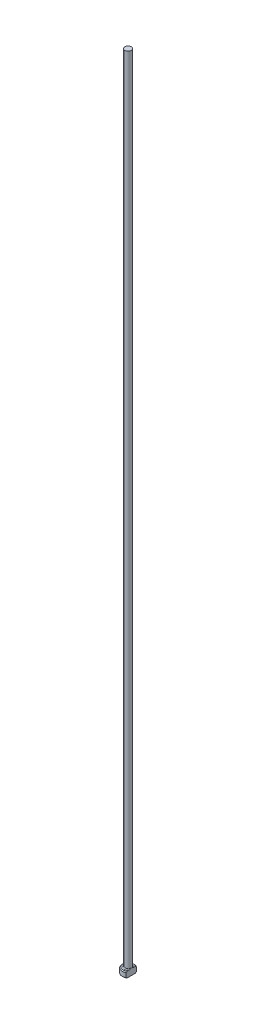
from build123d import *
from build123d.topology import SkipClean

# Parameters (mm, degrees)
CHAMFER1_SIZE = 0.2
FILLET1_R     = 0.2
KEY_DEPTH     = 201.011249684


with BuildPart() as part:
    # Sketch1 → Revolve1 (revolve)
    with BuildSketch(Plane.XY, mode=Mode.PRIVATE) as revolve1_sk:
        Polygon((0, 0), (-1.5, 0), (-1.5, 1.5), (-0.8, 1.5), (-0.8, 200), (0, 200), align=None)
    revolve(revolve1_sk.sketch.rotate(Axis((0, 259.958771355, 0), (0, -1, 0)), 270), axis=Axis((0, 259.958771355, 0), (0, -1, 0)))

    # Chamfer1
    chamfer1_edges = [part.edges().sort_by_distance(p)[0] for p in [
        (0, 1.5, -1.5),
        (0, 0, -1.5),
    ]]
    chamfer(chamfer1_edges, length=CHAMFER1_SIZE)

    # Fillet1
    fillet1_edges = [part.edges().sort_by_distance(p)[0] for p in [
        (0, 1.5, -0.8),
    ]]
    fillet(fillet1_edges, radius=FILLET1_R)

    # Sketch2 → KEY (cut, through all)
    with SkipClean():  # the faces are left unmerged after this step: merging them gives an invalid solid
        with BuildSketch(Plane(origin=(0, 0, 0), x_dir=(1, 0, 0), z_dir=(0, 1, 0))):
            with BuildLine():
                Line((0.8, 1.268857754), (0.8, -1.268857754))
                ThreePointArc((0.8, -1.268857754), (1.5, 0), (0.8, 1.268857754))
            make_face()
        extrude(amount=KEY_DEPTH, mode=Mode.SUBTRACT)


solid = part.part
